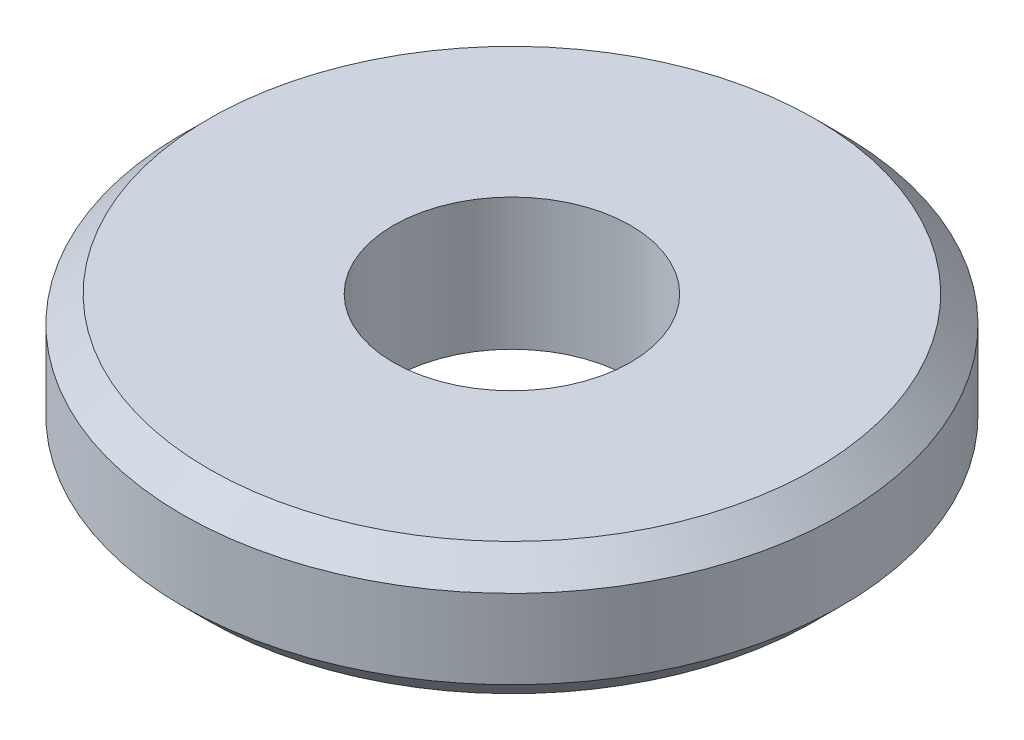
from build123d import *

# Parameters (mm, degrees)
SKETCH1_R      = 12.5
SKETCH1_R_2    = 4.5
EXTRUDE1_DEPTH = 5
CHAMFER1_SIZE  = 1


with BuildPart() as part:
    # Sketch1 → Extrude1 (new body)
    with BuildSketch(Plane(origin=(0, 0, 0), x_dir=(1, 0, 0), z_dir=(0, 1, 0))):
        with Locations(Location((0, 0, 0), (0, 0, 270))):
            Circle(SKETCH1_R)
        with Locations(Location((0, 0, 0), (0, 0, 270))):
            Circle(SKETCH1_R_2, mode=Mode.SUBTRACT)
    extrude(amount=EXTRUDE1_DEPTH)

    # Chamfer1
    chamfer1_edges = [part.edges().sort_by_distance(p)[0] for p in [
        (0, 0, -12.5),
        (0, 5, -12.5),
    ]]
    chamfer(chamfer1_edges, length=CHAMFER1_SIZE)


solid = part.part
